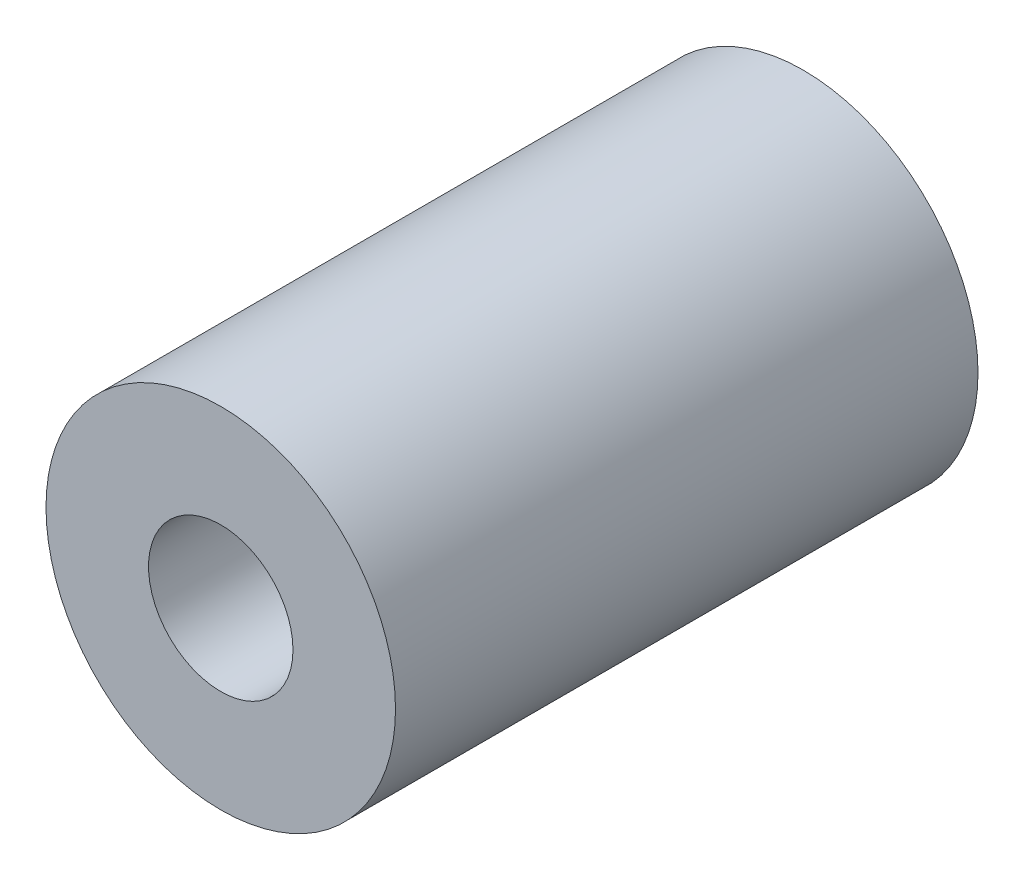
from build123d import *

# Parameters (mm, degrees)
SKETCH_1_R          = 7.5
EXTRUDE_1_DEPTH     = 25
SKETCH_2_R          = 3.1
CUT_EXTRUDE_1_DEPTH = 25


with BuildPart() as part:
    # Sketch 1 → Extrude 1 (new body)
    with BuildSketch(Plane.XY):
        Circle(SKETCH_1_R)
    extrude(amount=EXTRUDE_1_DEPTH)

    # Sketch 2 → Cut-Extrude 1 (cut)
    with BuildSketch(Plane.XY.offset(25)):
        Circle(SKETCH_2_R)
    extrude(amount=-CUT_EXTRUDE_1_DEPTH, mode=Mode.SUBTRACT)


solid = part.part
